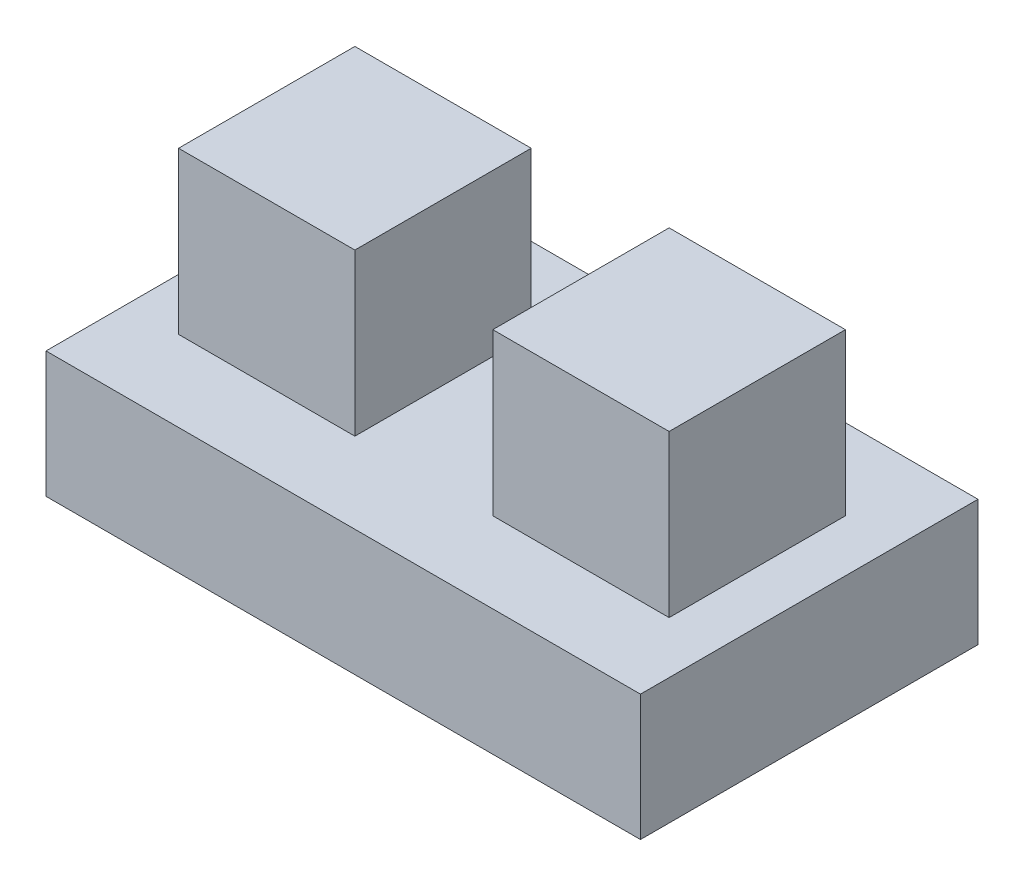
from build123d import *

# Parameters (mm, degrees)
SKIZZE1_W                       = 118
SKIZZE1_H                       = 67
AUFSATZ_LINEAR_AUSTRAGEN1_DEPTH = 25
SKIZZE2_W                       = 35
SKIZZE2_H                       = 35
AUFSATZ_LINEAR_AUSTRAGEN2_DEPTH = 32


with BuildPart() as part:
    # Skizze1 → Aufsatz-Linear austragen1 (new body)
    with BuildSketch(Plane(origin=(0, 0, 0), x_dir=(1, 0, 0), z_dir=(0, 1, 0))):
        Rectangle(SKIZZE1_W, SKIZZE1_H)
    extrude(amount=AUFSATZ_LINEAR_AUSTRAGEN1_DEPTH)

    # Skizze2 → Aufsatz-Linear austragen2 (add)
    with BuildSketch(Plane(origin=(0, 25, 0), x_dir=(1, 0, 0), z_dir=(0, 1, 0))):
        with Locations((-31.187445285, 0)):
            Rectangle(SKIZZE2_W, SKIZZE2_H)
        with Locations((31.187445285, 0)):
            Rectangle(SKIZZE2_W, SKIZZE2_H)
    extrude(amount=AUFSATZ_LINEAR_AUSTRAGEN2_DEPTH)


solid = part.part
